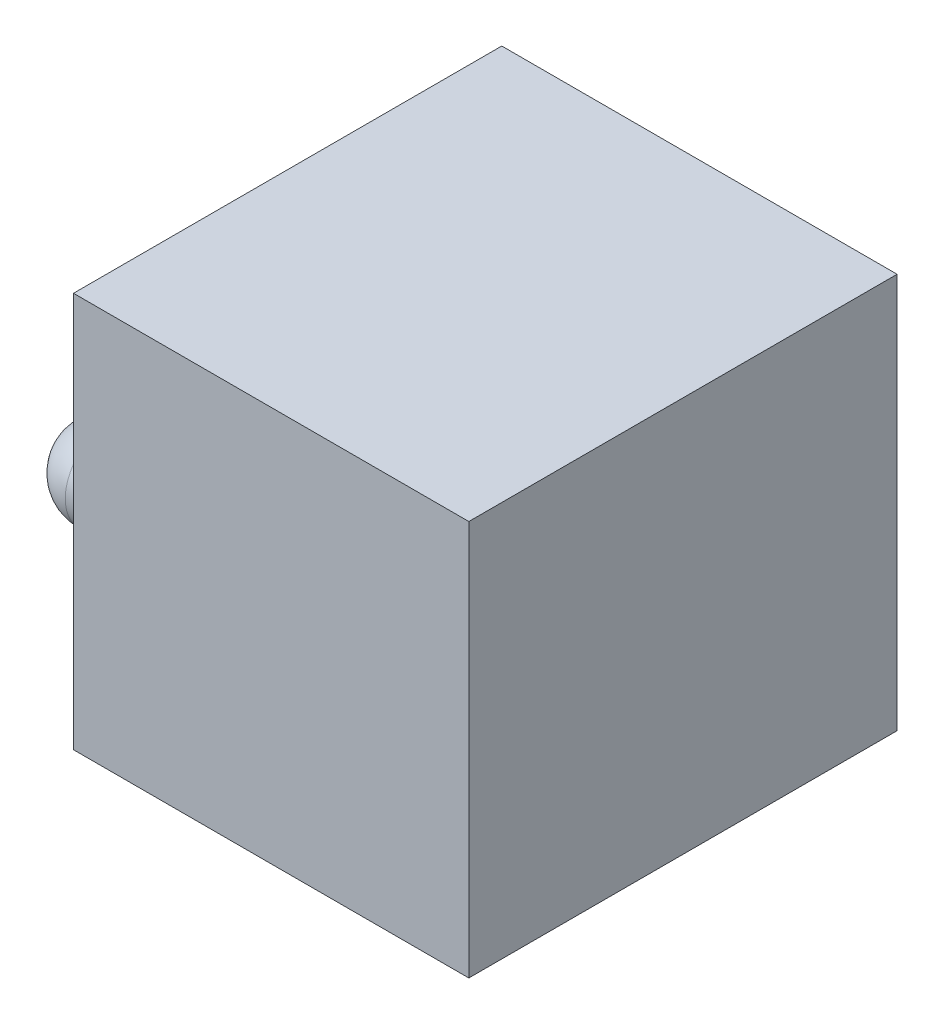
ISO-10303-21;
HEADER;
FILE_DESCRIPTION(('STEP AP214'),'2;1');
FILE_NAME('part.step','',(''),(''),'','','');
FILE_SCHEMA(('AUTOMOTIVE_DESIGN { 1 0 10303 214 1 1 1 1 }'));
ENDSEC;
DATA;
#1=APPLICATION_CONTEXT('core data for automotive mechanical design processes');
#2=APPLICATION_PROTOCOL_DEFINITION('international standard','automotive_design',2000,#1);
#3=PRODUCT_CONTEXT('',#1,'mechanical');
#4=PRODUCT('Part','Part','',(#3));
#5=PRODUCT_RELATED_PRODUCT_CATEGORY('part','',(#4));
#6=PRODUCT_DEFINITION_FORMATION('','',#4);
#7=PRODUCT_DEFINITION_CONTEXT('part definition',#1,'design');
#8=PRODUCT_DEFINITION('design','',#6,#7);
#9=PRODUCT_DEFINITION_SHAPE('','',#8);
#10=(LENGTH_UNIT() NAMED_UNIT(*) SI_UNIT(.MILLI.,.METRE.));
#11=(NAMED_UNIT(*) PLANE_ANGLE_UNIT() SI_UNIT($,.RADIAN.));
#12=(NAMED_UNIT(*) SI_UNIT($,.STERADIAN.) SOLID_ANGLE_UNIT());
#13=UNCERTAINTY_MEASURE_WITH_UNIT(LENGTH_MEASURE(1.E-05),#10,'distance_accuracy_value','');
#14=(GEOMETRIC_REPRESENTATION_CONTEXT(3) GLOBAL_UNCERTAINTY_ASSIGNED_CONTEXT((#13)) GLOBAL_UNIT_ASSIGNED_CONTEXT((#10,
#11,#12)) REPRESENTATION_CONTEXT('',''));
#15=CARTESIAN_POINT('',(0.,0.,0.));
#16=DIRECTION('',(0.,0.,1.));
#17=DIRECTION('',(1.,0.,0.));
#18=AXIS2_PLACEMENT_3D('',#15,#16,#17);
#19=CARTESIAN_POINT('',(12.,24.,13.));
#20=DIRECTION('',(-1.,0.,0.));
#21=DIRECTION('',(0.,0.,1.));
#22=AXIS2_PLACEMENT_3D('',#19,#20,#21);
#23=PLANE('',#22);
#24=DIRECTION('',(0.,0.,-1.));
#25=VECTOR('',#24,1.);
#26=CARTESIAN_POINT('',(12.,0.,13.));
#27=LINE('',#26,#25);
#28=CARTESIAN_POINT('',(12.,0.,13.));
#29=VERTEX_POINT('',#28);
#30=CARTESIAN_POINT('',(12.,0.,-13.));
#31=VERTEX_POINT('',#30);
#32=EDGE_CURVE('E110',#29,#31,#27,.T.);
#33=ORIENTED_EDGE('',*,*,#32,.T.);
#34=DIRECTION('',(0.,-1.,0.));
#35=VECTOR('',#34,1.);
#36=CARTESIAN_POINT('',(12.,24.,-13.));
#37=LINE('',#36,#35);
#38=CARTESIAN_POINT('',(12.,24.,-13.));
#39=VERTEX_POINT('',#38);
#40=EDGE_CURVE('E98',#39,#31,#37,.T.);
#41=ORIENTED_EDGE('',*,*,#40,.F.);
#42=DIRECTION('',(0.,0.,-1.));
#43=VECTOR('',#42,1.);
#44=CARTESIAN_POINT('',(12.,24.,13.));
#45=LINE('',#44,#43);
#46=CARTESIAN_POINT('',(12.,24.,13.));
#47=VERTEX_POINT('',#46);
#48=EDGE_CURVE('E95',#47,#39,#45,.T.);
#49=ORIENTED_EDGE('',*,*,#48,.F.);
#50=DIRECTION('',(0.,-1.,0.));
#51=VECTOR('',#50,1.);
#52=CARTESIAN_POINT('',(12.,24.,13.));
#53=LINE('',#52,#51);
#54=EDGE_CURVE('E103',#47,#29,#53,.T.);
#55=ORIENTED_EDGE('',*,*,#54,.T.);
#56=EDGE_LOOP('',(#33,#41,#49,#55));
#57=FACE_BOUND('',#56,.T.);
#58=ADVANCED_FACE('F39',(#57),#23,.F.);
#59=CARTESIAN_POINT('',(-12.,24.,-13.));
#60=DIRECTION('',(0.,0.,1.));
#61=DIRECTION('',(1.,0.,0.));
#62=AXIS2_PLACEMENT_3D('',#59,#60,#61);
#63=PLANE('',#62);
#64=DIRECTION('',(-1.,0.,0.));
#65=VECTOR('',#64,1.);
#66=CARTESIAN_POINT('',(-12.,0.,-13.));
#67=LINE('',#66,#65);
#68=CARTESIAN_POINT('',(-12.,0.,-13.));
#69=VERTEX_POINT('',#68);
#70=EDGE_CURVE('E100',#31,#69,#67,.T.);
#71=ORIENTED_EDGE('',*,*,#70,.T.);
#72=DIRECTION('',(0.,-1.,0.));
#73=VECTOR('',#72,1.);
#74=CARTESIAN_POINT('',(-12.,24.,-13.));
#75=LINE('',#74,#73);
#76=CARTESIAN_POINT('',(-12.,24.,-13.));
#77=VERTEX_POINT('',#76);
#78=EDGE_CURVE('E92',#77,#69,#75,.T.);
#79=ORIENTED_EDGE('',*,*,#78,.F.);
#80=DIRECTION('',(-1.,0.,0.));
#81=VECTOR('',#80,1.);
#82=CARTESIAN_POINT('',(-12.,24.,-13.));
#83=LINE('',#82,#81);
#84=EDGE_CURVE('E87',#39,#77,#83,.T.);
#85=ORIENTED_EDGE('',*,*,#84,.F.);
#86=ORIENTED_EDGE('',*,*,#40,.T.);
#87=EDGE_LOOP('',(#71,#79,#85,#86));
#88=FACE_BOUND('',#87,.T.);
#89=ADVANCED_FACE('F96',(#88),#63,.F.);
#90=CARTESIAN_POINT('',(-12.,24.,13.));
#91=DIRECTION('',(1.,0.,0.));
#92=DIRECTION('',(0.,0.,-1.));
#93=AXIS2_PLACEMENT_3D('',#90,#91,#92);
#94=PLANE('',#93);
#95=CARTESIAN_POINT('',(-12.,7.14887324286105,4.5));
#96=DIRECTION('',(1.,0.,0.));
#97=DIRECTION('',(0.,0.,-1.));
#98=AXIS2_PLACEMENT_3D('',#95,#96,#97);
#99=CIRCLE('',#98,2.7);
#100=CARTESIAN_POINT('',(-12.,7.14887324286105,1.8));
#101=VERTEX_POINT('',#100);
#102=EDGE_CURVE('E109',#101,#101,#99,.T.);
#103=ORIENTED_EDGE('',*,*,#102,.T.);
#104=EDGE_LOOP('',(#103));
#105=FACE_BOUND('',#104,.T.);
#106=CARTESIAN_POINT('',(-12.,7.14887324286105,-4.5));
#107=DIRECTION('',(-1.,0.,0.));
#108=DIRECTION('',(0.,0.,1.));
#109=AXIS2_PLACEMENT_3D('',#106,#107,#108);
#110=CIRCLE('',#109,2.7);
#111=CARTESIAN_POINT('',(-12.,7.14887324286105,-1.8));
#112=VERTEX_POINT('',#111);
#113=EDGE_CURVE('E117',#112,#112,#110,.T.);
#114=ORIENTED_EDGE('',*,*,#113,.F.);
#115=EDGE_LOOP('',(#114));
#116=FACE_BOUND('',#115,.T.);
#117=DIRECTION('',(0.,0.,1.));
#118=VECTOR('',#117,1.);
#119=CARTESIAN_POINT('',(-12.,0.,13.));
#120=LINE('',#119,#118);
#121=CARTESIAN_POINT('',(-12.,0.,13.));
#122=VERTEX_POINT('',#121);
#123=EDGE_CURVE('E71',#69,#122,#120,.T.);
#124=ORIENTED_EDGE('',*,*,#123,.T.);
#125=DIRECTION('',(0.,-1.,0.));
#126=VECTOR('',#125,1.);
#127=CARTESIAN_POINT('',(-12.,24.,13.));
#128=LINE('',#127,#126);
#129=CARTESIAN_POINT('',(-12.,24.,13.));
#130=VERTEX_POINT('',#129);
#131=EDGE_CURVE('E97',#130,#122,#128,.T.);
#132=ORIENTED_EDGE('',*,*,#131,.F.);
#133=DIRECTION('',(0.,0.,1.));
#134=VECTOR('',#133,1.);
#135=CARTESIAN_POINT('',(-12.,24.,13.));
#136=LINE('',#135,#134);
#137=EDGE_CURVE('E89',#77,#130,#136,.T.);
#138=ORIENTED_EDGE('',*,*,#137,.F.);
#139=ORIENTED_EDGE('',*,*,#78,.T.);
#140=EDGE_LOOP('',(#124,#132,#138,#139));
#141=FACE_BOUND('',#140,.T.);
#142=ADVANCED_FACE('F101',(#105,#116,#141),#94,.F.);
#143=CARTESIAN_POINT('',(-12.,24.,13.));
#144=DIRECTION('',(0.,0.,-1.));
#145=DIRECTION('',(-1.,0.,0.));
#146=AXIS2_PLACEMENT_3D('',#143,#144,#145);
#147=PLANE('',#146);
#148=DIRECTION('',(1.,0.,0.));
#149=VECTOR('',#148,1.);
#150=CARTESIAN_POINT('',(-12.,0.,13.));
#151=LINE('',#150,#149);
#152=EDGE_CURVE('E76',#122,#29,#151,.T.);
#153=ORIENTED_EDGE('',*,*,#152,.T.);
#154=ORIENTED_EDGE('',*,*,#54,.F.);
#155=DIRECTION('',(1.,0.,0.));
#156=VECTOR('',#155,1.);
#157=CARTESIAN_POINT('',(-12.,24.,13.));
#158=LINE('',#157,#156);
#159=EDGE_CURVE('E57',#130,#47,#158,.T.);
#160=ORIENTED_EDGE('',*,*,#159,.F.);
#161=ORIENTED_EDGE('',*,*,#131,.T.);
#162=EDGE_LOOP('',(#153,#154,#160,#161));
#163=FACE_BOUND('',#162,.T.);
#164=ADVANCED_FACE('F153',(#163),#147,.F.);
#165=CARTESIAN_POINT('',(0.,24.,0.));
#166=DIRECTION('',(0.,-1.,0.));
#167=DIRECTION('',(0.,0.,-1.));
#168=AXIS2_PLACEMENT_3D('',#165,#166,#167);
#169=PLANE('',#168);
#170=ORIENTED_EDGE('',*,*,#48,.T.);
#171=ORIENTED_EDGE('',*,*,#84,.T.);
#172=ORIENTED_EDGE('',*,*,#137,.T.);
#173=ORIENTED_EDGE('',*,*,#159,.T.);
#174=EDGE_LOOP('',(#170,#171,#172,#173));
#175=FACE_BOUND('',#174,.T.);
#176=ADVANCED_FACE('F86',(#175),#169,.F.);
#177=CARTESIAN_POINT('',(0.,0.,0.));
#178=DIRECTION('',(0.,-1.,0.));
#179=DIRECTION('',(0.,0.,-1.));
#180=AXIS2_PLACEMENT_3D('',#177,#178,#179);
#181=PLANE('',#180);
#182=ORIENTED_EDGE('',*,*,#32,.F.);
#183=ORIENTED_EDGE('',*,*,#152,.F.);
#184=ORIENTED_EDGE('',*,*,#123,.F.);
#185=ORIENTED_EDGE('',*,*,#70,.F.);
#186=EDGE_LOOP('',(#182,#183,#184,#185));
#187=FACE_BOUND('',#186,.T.);
#188=ADVANCED_FACE('F156',(#187),#181,.T.);
#189=CARTESIAN_POINT('',(-21.,7.14887324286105,-4.5));
#190=DIRECTION('',(1.,0.,0.));
#191=DIRECTION('',(0.,0.,-1.));
#192=AXIS2_PLACEMENT_3D('',#189,#190,#191);
#193=CYLINDRICAL_SURFACE('',#192,2.7);
#194=CARTESIAN_POINT('',(-18.3,7.14887324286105,-4.5));
#195=DIRECTION('',(1.,0.,0.));
#196=DIRECTION('',(0.,0.,-1.));
#197=AXIS2_PLACEMENT_3D('',#194,#195,#196);
#198=CIRCLE('',#197,2.7);
#199=CARTESIAN_POINT('',(-18.3,7.14887324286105,-7.2));
#200=VERTEX_POINT('',#199);
#201=EDGE_CURVE('E48',#200,#200,#198,.T.);
#202=ORIENTED_EDGE('',*,*,#201,.T.);
#203=EDGE_LOOP('',(#202));
#204=FACE_BOUND('',#203,.T.);
#205=ORIENTED_EDGE('',*,*,#113,.T.);
#206=EDGE_LOOP('',(#205));
#207=FACE_BOUND('',#206,.T.);
#208=ADVANCED_FACE('F143',(#204,#207),#193,.T.);
#209=CARTESIAN_POINT('',(-18.3,7.14887324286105,-4.5));
#210=DIRECTION('',(-1.,0.,0.));
#211=DIRECTION('',(0.,0.,1.));
#212=AXIS2_PLACEMENT_3D('',#209,#210,#211);
#213=SPHERICAL_SURFACE('',#212,2.7);
#214=ORIENTED_EDGE('',*,*,#201,.F.);
#215=EDGE_LOOP('',(#214));
#216=FACE_BOUND('',#215,.T.);
#217=ADVANCED_FACE('F134',(#216),#213,.T.);
#218=CARTESIAN_POINT('',(-21.,7.14887324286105,4.5));
#219=DIRECTION('',(1.,0.,0.));
#220=DIRECTION('',(0.,0.,-1.));
#221=AXIS2_PLACEMENT_3D('',#218,#219,#220);
#222=CYLINDRICAL_SURFACE('',#221,2.7);
#223=CARTESIAN_POINT('',(-18.3,7.14887324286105,4.5));
#224=DIRECTION('',(1.,0.,0.));
#225=DIRECTION('',(0.,0.,-1.));
#226=AXIS2_PLACEMENT_3D('',#223,#224,#225);
#227=CIRCLE('',#226,2.7);
#228=CARTESIAN_POINT('',(-18.3,7.14887324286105,1.8));
#229=VERTEX_POINT('',#228);
#230=EDGE_CURVE('E11',#229,#229,#227,.T.);
#231=ORIENTED_EDGE('',*,*,#230,.T.);
#232=EDGE_LOOP('',(#231));
#233=FACE_BOUND('',#232,.T.);
#234=ORIENTED_EDGE('',*,*,#102,.F.);
#235=EDGE_LOOP('',(#234));
#236=FACE_BOUND('',#235,.T.);
#237=ADVANCED_FACE('F128',(#233,#236),#222,.T.);
#238=CARTESIAN_POINT('',(-18.3,7.14887324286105,4.5));
#239=DIRECTION('',(-1.,0.,0.));
#240=DIRECTION('',(0.,0.,1.));
#241=AXIS2_PLACEMENT_3D('',#238,#239,#240);
#242=SPHERICAL_SURFACE('',#241,2.7);
#243=ORIENTED_EDGE('',*,*,#230,.F.);
#244=EDGE_LOOP('',(#243));
#245=FACE_BOUND('',#244,.T.);
#246=ADVANCED_FACE('F41',(#245),#242,.T.);
#247=CLOSED_SHELL('',(#58,#89,#142,#164,#176,#188,#208,#217,#237,#246));
#248=MANIFOLD_SOLID_BREP('B2',#247);
#249=ADVANCED_BREP_SHAPE_REPRESENTATION('',(#18,#248),#14);
#250=SHAPE_DEFINITION_REPRESENTATION(#9,#249);
ENDSEC;
END-ISO-10303-21;
